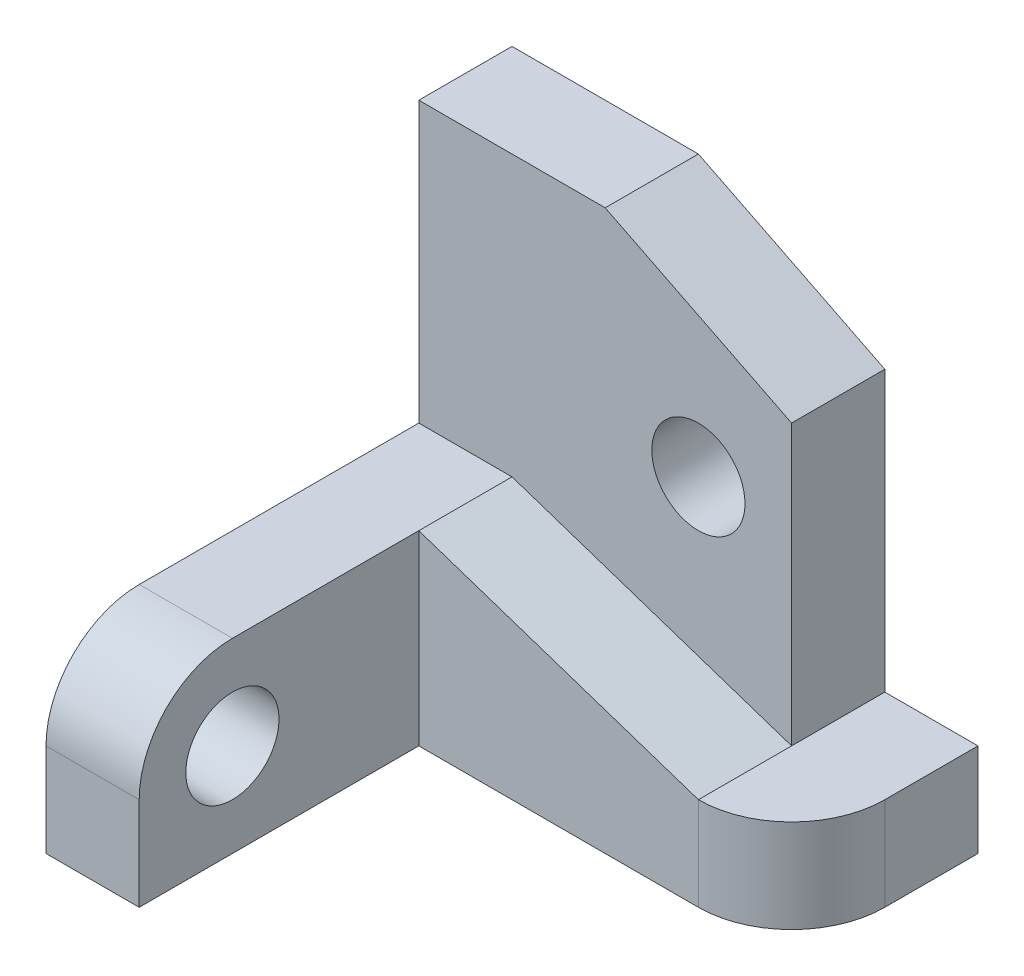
ISO-10303-21;
HEADER;
FILE_DESCRIPTION(('STEP AP214'),'2;1');
FILE_NAME('part.step','',(''),(''),'','','');
FILE_SCHEMA(('AUTOMOTIVE_DESIGN { 1 0 10303 214 1 1 1 1 }'));
ENDSEC;
DATA;
#1=APPLICATION_CONTEXT('core data for automotive mechanical design processes');
#2=APPLICATION_PROTOCOL_DEFINITION('international standard','automotive_design',2000,#1);
#3=PRODUCT_CONTEXT('',#1,'mechanical');
#4=PRODUCT('Part','Part','',(#3));
#5=PRODUCT_RELATED_PRODUCT_CATEGORY('part','',(#4));
#6=PRODUCT_DEFINITION_FORMATION('','',#4);
#7=PRODUCT_DEFINITION_CONTEXT('part definition',#1,'design');
#8=PRODUCT_DEFINITION('design','',#6,#7);
#9=PRODUCT_DEFINITION_SHAPE('','',#8);
#10=(LENGTH_UNIT() NAMED_UNIT(*) SI_UNIT(.MILLI.,.METRE.));
#11=(NAMED_UNIT(*) PLANE_ANGLE_UNIT() SI_UNIT($,.RADIAN.));
#12=(NAMED_UNIT(*) SI_UNIT($,.STERADIAN.) SOLID_ANGLE_UNIT());
#13=UNCERTAINTY_MEASURE_WITH_UNIT(LENGTH_MEASURE(1.E-05),#10,'distance_accuracy_value','');
#14=(GEOMETRIC_REPRESENTATION_CONTEXT(3) GLOBAL_UNCERTAINTY_ASSIGNED_CONTEXT((#13)) GLOBAL_UNIT_ASSIGNED_CONTEXT((#10,
#11,#12)) REPRESENTATION_CONTEXT('',''));
#15=CARTESIAN_POINT('',(0.,0.,0.));
#16=DIRECTION('',(0.,0.,1.));
#17=DIRECTION('',(1.,0.,0.));
#18=AXIS2_PLACEMENT_3D('',#15,#16,#17);
#19=CARTESIAN_POINT('',(40.,-43.0593932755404,10.));
#20=DIRECTION('',(1.,0.,0.));
#21=DIRECTION('',(0.,1.,0.));
#22=AXIS2_PLACEMENT_3D('',#19,#20,#21);
#23=PLANE('',#22);
#24=DIRECTION('',(0.,-1.,0.));
#25=VECTOR('',#24,1.);
#26=CARTESIAN_POINT('',(40.,-43.0593932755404,0.));
#27=LINE('',#26,#25);
#28=CARTESIAN_POINT('',(40.,40.,0.));
#29=VERTEX_POINT('',#28);
#30=CARTESIAN_POINT('',(40.,10.,0.));
#31=VERTEX_POINT('',#30);
#32=EDGE_CURVE('E205',#29,#31,#27,.T.);
#33=ORIENTED_EDGE('',*,*,#32,.F.);
#34=DIRECTION('',(0.,0.,-1.));
#35=VECTOR('',#34,1.);
#36=CARTESIAN_POINT('',(40.,40.,10.));
#37=LINE('',#36,#35);
#38=CARTESIAN_POINT('',(40.,40.,10.));
#39=VERTEX_POINT('',#38);
#40=EDGE_CURVE('E221',#39,#29,#37,.T.);
#41=ORIENTED_EDGE('',*,*,#40,.F.);
#42=DIRECTION('',(0.,-1.,0.));
#43=VECTOR('',#42,1.);
#44=CARTESIAN_POINT('',(40.,-43.0593932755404,10.));
#45=LINE('',#44,#43);
#46=CARTESIAN_POINT('',(40.,10.,10.));
#47=VERTEX_POINT('',#46);
#48=EDGE_CURVE('E184',#39,#47,#45,.T.);
#49=ORIENTED_EDGE('',*,*,#48,.T.);
#50=DIRECTION('',(0.,0.,-1.));
#51=VECTOR('',#50,1.);
#52=CARTESIAN_POINT('',(40.,10.,10.));
#53=LINE('',#52,#51);
#54=EDGE_CURVE('E202',#47,#31,#53,.T.);
#55=ORIENTED_EDGE('',*,*,#54,.T.);
#56=EDGE_LOOP('',(#33,#41,#49,#55));
#57=FACE_BOUND('',#56,.T.);
#58=ADVANCED_FACE('F32',(#57),#23,.T.);
#59=CARTESIAN_POINT('',(54.2837156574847,32.8581421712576,10.));
#60=DIRECTION('',(0.447213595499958,0.894427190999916,0.));
#61=DIRECTION('',(-0.894427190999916,0.447213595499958,0.));
#62=AXIS2_PLACEMENT_3D('',#59,#60,#61);
#63=PLANE('',#62);
#64=DIRECTION('',(0.894427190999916,-0.447213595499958,0.));
#65=VECTOR('',#64,1.);
#66=CARTESIAN_POINT('',(54.2837156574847,32.8581421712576,0.));
#67=LINE('',#66,#65);
#68=CARTESIAN_POINT('',(20.,50.,0.));
#69=VERTEX_POINT('',#68);
#70=EDGE_CURVE('E208',#69,#29,#67,.T.);
#71=ORIENTED_EDGE('',*,*,#70,.F.);
#72=DIRECTION('',(0.,0.,-1.));
#73=VECTOR('',#72,1.);
#74=CARTESIAN_POINT('',(20.,50.,10.));
#75=LINE('',#74,#73);
#76=CARTESIAN_POINT('',(20.,50.,10.));
#77=VERTEX_POINT('',#76);
#78=EDGE_CURVE('E219',#77,#69,#75,.T.);
#79=ORIENTED_EDGE('',*,*,#78,.F.);
#80=DIRECTION('',(0.894427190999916,-0.447213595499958,0.));
#81=VECTOR('',#80,1.);
#82=CARTESIAN_POINT('',(54.2837156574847,32.8581421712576,10.));
#83=LINE('',#82,#81);
#84=EDGE_CURVE('E187',#77,#39,#83,.T.);
#85=ORIENTED_EDGE('',*,*,#84,.T.);
#86=ORIENTED_EDGE('',*,*,#40,.T.);
#87=EDGE_LOOP('',(#71,#79,#85,#86));
#88=FACE_BOUND('',#87,.T.);
#89=ADVANCED_FACE('F263',(#88),#63,.T.);
#90=CARTESIAN_POINT('',(16.3249479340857,50.,10.));
#91=DIRECTION('',(0.,1.,0.));
#92=DIRECTION('',(0.,0.,1.));
#93=AXIS2_PLACEMENT_3D('',#90,#91,#92);
#94=PLANE('',#93);
#95=DIRECTION('',(1.,0.,0.));
#96=VECTOR('',#95,1.);
#97=CARTESIAN_POINT('',(16.3249479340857,50.,0.));
#98=LINE('',#97,#96);
#99=CARTESIAN_POINT('',(0.,50.,0.));
#100=VERTEX_POINT('',#99);
#101=EDGE_CURVE('E211',#100,#69,#98,.T.);
#102=ORIENTED_EDGE('',*,*,#101,.F.);
#103=DIRECTION('',(0.,0.,-1.));
#104=VECTOR('',#103,1.);
#105=CARTESIAN_POINT('',(0.,50.,10.));
#106=LINE('',#105,#104);
#107=CARTESIAN_POINT('',(0.,50.,10.));
#108=VERTEX_POINT('',#107);
#109=EDGE_CURVE('E217',#108,#100,#106,.T.);
#110=ORIENTED_EDGE('',*,*,#109,.F.);
#111=DIRECTION('',(1.,0.,0.));
#112=VECTOR('',#111,1.);
#113=CARTESIAN_POINT('',(16.3249479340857,50.,10.));
#114=LINE('',#113,#112);
#115=EDGE_CURVE('E190',#108,#77,#114,.T.);
#116=ORIENTED_EDGE('',*,*,#115,.T.);
#117=ORIENTED_EDGE('',*,*,#78,.T.);
#118=EDGE_LOOP('',(#102,#110,#116,#117));
#119=FACE_BOUND('',#118,.T.);
#120=ADVANCED_FACE('F269',(#119),#94,.T.);
#121=CARTESIAN_POINT('',(0.,-43.0593932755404,10.));
#122=DIRECTION('',(-1.,0.,0.));
#123=DIRECTION('',(0.,0.,1.));
#124=AXIS2_PLACEMENT_3D('',#121,#122,#123);
#125=PLANE('',#124);
#126=CARTESIAN_POINT('',(0.,10.,40.));
#127=DIRECTION('',(-1.,0.,0.));
#128=DIRECTION('',(0.,0.,1.));
#129=AXIS2_PLACEMENT_3D('',#126,#127,#128);
#130=CIRCLE('',#129,5.);
#131=CARTESIAN_POINT('',(0.,10.,45.));
#132=VERTEX_POINT('',#131);
#133=EDGE_CURVE('E312',#132,#132,#130,.T.);
#134=ORIENTED_EDGE('',*,*,#133,.F.);
#135=EDGE_LOOP('',(#134));
#136=FACE_BOUND('',#135,.T.);
#137=DIRECTION('',(0.,-1.,0.));
#138=VECTOR('',#137,1.);
#139=CARTESIAN_POINT('',(0.,-43.0593932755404,50.));
#140=LINE('',#139,#138);
#141=CARTESIAN_POINT('',(0.,9.99999999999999,50.));
#142=VERTEX_POINT('',#141);
#143=CARTESIAN_POINT('',(0.,0.,50.));
#144=VERTEX_POINT('',#143);
#145=EDGE_CURVE('E123',#142,#144,#140,.T.);
#146=ORIENTED_EDGE('',*,*,#145,.F.);
#147=CARTESIAN_POINT('',(0.,9.99999999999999,40.));
#148=DIRECTION('',(-1.,0.,0.));
#149=DIRECTION('',(0.,0.,1.));
#150=AXIS2_PLACEMENT_3D('',#147,#148,#149);
#151=CIRCLE('',#150,10.);
#152=CARTESIAN_POINT('',(0.,20.,40.));
#153=VERTEX_POINT('',#152);
#154=EDGE_CURVE('E224',#142,#153,#151,.T.);
#155=ORIENTED_EDGE('',*,*,#154,.T.);
#156=DIRECTION('',(0.,0.,-1.));
#157=VECTOR('',#156,1.);
#158=CARTESIAN_POINT('',(0.,20.,50.));
#159=LINE('',#158,#157);
#160=CARTESIAN_POINT('',(0.,20.,10.));
#161=VERTEX_POINT('',#160);
#162=EDGE_CURVE('E143',#153,#161,#159,.T.);
#163=ORIENTED_EDGE('',*,*,#162,.T.);
#164=DIRECTION('',(0.,1.,0.));
#165=VECTOR('',#164,1.);
#166=CARTESIAN_POINT('',(0.,-43.0593932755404,10.));
#167=LINE('',#166,#165);
#168=EDGE_CURVE('E193',#161,#108,#167,.T.);
#169=ORIENTED_EDGE('',*,*,#168,.T.);
#170=ORIENTED_EDGE('',*,*,#109,.T.);
#171=DIRECTION('',(0.,1.,0.));
#172=VECTOR('',#171,1.);
#173=CARTESIAN_POINT('',(0.,-43.0593932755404,0.));
#174=LINE('',#173,#172);
#175=CARTESIAN_POINT('',(0.,0.,0.));
#176=VERTEX_POINT('',#175);
#177=EDGE_CURVE('E139',#176,#100,#174,.T.);
#178=ORIENTED_EDGE('',*,*,#177,.F.);
#179=DIRECTION('',(0.,0.,-1.));
#180=VECTOR('',#179,1.);
#181=CARTESIAN_POINT('',(0.,0.,50.));
#182=LINE('',#181,#180);
#183=EDGE_CURVE('E136',#144,#176,#182,.T.);
#184=ORIENTED_EDGE('',*,*,#183,.F.);
#185=EDGE_LOOP('',(#146,#155,#163,#169,#170,#178,#184));
#186=FACE_BOUND('',#185,.T.);
#187=ADVANCED_FACE('F137',(#136,#186),#125,.T.);
#188=CARTESIAN_POINT('',(30.,30.,10.));
#189=DIRECTION('',(0.,0.,-1.));
#190=DIRECTION('',(-1.,0.,0.));
#191=AXIS2_PLACEMENT_3D('',#188,#189,#190);
#192=CYLINDRICAL_SURFACE('',#191,5.);
#193=CARTESIAN_POINT('',(30.,30.,10.));
#194=DIRECTION('',(0.,0.,1.));
#195=DIRECTION('',(1.,0.,0.));
#196=AXIS2_PLACEMENT_3D('',#193,#194,#195);
#197=CIRCLE('',#196,5.);
#198=CARTESIAN_POINT('',(35.,30.,10.));
#199=VERTEX_POINT('',#198);
#200=EDGE_CURVE('E181',#199,#199,#197,.T.);
#201=ORIENTED_EDGE('',*,*,#200,.T.);
#202=EDGE_LOOP('',(#201));
#203=FACE_BOUND('',#202,.T.);
#204=CARTESIAN_POINT('',(30.,30.,0.));
#205=DIRECTION('',(0.,0.,1.));
#206=DIRECTION('',(1.,0.,0.));
#207=AXIS2_PLACEMENT_3D('',#204,#205,#206);
#208=CIRCLE('',#207,5.);
#209=CARTESIAN_POINT('',(35.,30.,0.));
#210=VERTEX_POINT('',#209);
#211=EDGE_CURVE('E180',#210,#210,#208,.T.);
#212=ORIENTED_EDGE('',*,*,#211,.F.);
#213=EDGE_LOOP('',(#212));
#214=FACE_BOUND('',#213,.T.);
#215=ADVANCED_FACE('F275',(#203,#214),#192,.F.);
#216=CARTESIAN_POINT('',(16.3249479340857,-43.0593932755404,10.));
#217=DIRECTION('',(0.,0.,1.));
#218=DIRECTION('',(1.,0.,0.));
#219=AXIS2_PLACEMENT_3D('',#216,#217,#218);
#220=PLANE('',#219);
#221=ORIENTED_EDGE('',*,*,#200,.F.);
#222=EDGE_LOOP('',(#221));
#223=FACE_BOUND('',#222,.T.);
#224=ORIENTED_EDGE('',*,*,#48,.F.);
#225=ORIENTED_EDGE('',*,*,#84,.F.);
#226=ORIENTED_EDGE('',*,*,#115,.F.);
#227=ORIENTED_EDGE('',*,*,#168,.F.);
#228=DIRECTION('',(-1.,0.,0.));
#229=VECTOR('',#228,1.);
#230=CARTESIAN_POINT('',(16.3249479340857,20.,10.));
#231=LINE('',#230,#229);
#232=CARTESIAN_POINT('',(10.,20.,10.));
#233=VERTEX_POINT('',#232);
#234=EDGE_CURVE('E196',#233,#161,#231,.T.);
#235=ORIENTED_EDGE('',*,*,#234,.F.);
#236=DIRECTION('',(-0.948683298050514,0.316227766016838,0.));
#237=VECTOR('',#236,1.);
#238=CARTESIAN_POINT('',(34.6102711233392,11.7965762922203,10.));
#239=LINE('',#238,#237);
#240=EDGE_CURVE('E199',#47,#233,#239,.T.);
#241=ORIENTED_EDGE('',*,*,#240,.F.);
#242=EDGE_LOOP('',(#224,#225,#226,#227,#235,#241));
#243=FACE_BOUND('',#242,.T.);
#244=ADVANCED_FACE('F277',(#223,#243),#220,.T.);
#245=CARTESIAN_POINT('',(16.3249479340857,-43.0593932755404,0.));
#246=DIRECTION('',(0.,0.,1.));
#247=DIRECTION('',(1.,0.,0.));
#248=AXIS2_PLACEMENT_3D('',#245,#246,#247);
#249=PLANE('',#248);
#250=DIRECTION('',(1.,0.,0.));
#251=VECTOR('',#250,1.);
#252=CARTESIAN_POINT('',(16.3249479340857,0.,0.));
#253=LINE('',#252,#251);
#254=CARTESIAN_POINT('',(50.,0.,0.));
#255=VERTEX_POINT('',#254);
#256=EDGE_CURVE('E155',#176,#255,#253,.T.);
#257=ORIENTED_EDGE('',*,*,#256,.F.);
#258=ORIENTED_EDGE('',*,*,#177,.T.);
#259=ORIENTED_EDGE('',*,*,#101,.T.);
#260=ORIENTED_EDGE('',*,*,#70,.T.);
#261=ORIENTED_EDGE('',*,*,#32,.T.);
#262=DIRECTION('',(-1.,0.,0.));
#263=VECTOR('',#262,1.);
#264=CARTESIAN_POINT('',(16.3249479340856,9.99999999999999,0.));
#265=LINE('',#264,#263);
#266=CARTESIAN_POINT('',(50.,10.,0.));
#267=VERTEX_POINT('',#266);
#268=EDGE_CURVE('E160',#267,#31,#265,.T.);
#269=ORIENTED_EDGE('',*,*,#268,.F.);
#270=DIRECTION('',(0.,1.,0.));
#271=VECTOR('',#270,1.);
#272=CARTESIAN_POINT('',(50.,-43.0593932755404,0.));
#273=LINE('',#272,#271);
#274=EDGE_CURVE('E168',#255,#267,#273,.T.);
#275=ORIENTED_EDGE('',*,*,#274,.F.);
#276=EDGE_LOOP('',(#257,#258,#259,#260,#261,#269,#275));
#277=FACE_BOUND('',#276,.T.);
#278=ORIENTED_EDGE('',*,*,#211,.T.);
#279=EDGE_LOOP('',(#278));
#280=FACE_BOUND('',#279,.T.);
#281=ADVANCED_FACE('F283',(#277,#280),#249,.F.);
#282=CARTESIAN_POINT('',(34.6102711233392,11.7965762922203,20.));
#283=DIRECTION('',(-0.316227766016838,-0.948683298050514,0.));
#284=DIRECTION('',(0.948683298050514,-0.316227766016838,0.));
#285=AXIS2_PLACEMENT_3D('',#282,#283,#284);
#286=PLANE('',#285);
#287=ORIENTED_EDGE('',*,*,#240,.T.);
#288=DIRECTION('',(0.,0.,-1.));
#289=VECTOR('',#288,1.);
#290=CARTESIAN_POINT('',(10.,20.,20.));
#291=LINE('',#290,#289);
#292=CARTESIAN_POINT('',(10.,20.,20.));
#293=VERTEX_POINT('',#292);
#294=EDGE_CURVE('E178',#293,#233,#291,.T.);
#295=ORIENTED_EDGE('',*,*,#294,.F.);
#296=DIRECTION('',(-0.948683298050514,0.316227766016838,0.));
#297=VECTOR('',#296,1.);
#298=CARTESIAN_POINT('',(34.6102711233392,11.7965762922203,20.));
#299=LINE('',#298,#297);
#300=CARTESIAN_POINT('',(40.,10.,20.));
#301=VERTEX_POINT('',#300);
#302=EDGE_CURVE('E156',#301,#293,#299,.T.);
#303=ORIENTED_EDGE('',*,*,#302,.F.);
#304=DIRECTION('',(0.,0.,-1.));
#305=VECTOR('',#304,1.);
#306=CARTESIAN_POINT('',(40.,10.,20.));
#307=LINE('',#306,#305);
#308=EDGE_CURVE('E166',#301,#47,#307,.T.);
#309=ORIENTED_EDGE('',*,*,#308,.T.);
#310=EDGE_LOOP('',(#287,#295,#303,#309));
#311=FACE_BOUND('',#310,.T.);
#312=ADVANCED_FACE('F242',(#311),#286,.F.);
#313=CARTESIAN_POINT('',(16.3249479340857,0.,20.));
#314=DIRECTION('',(0.,1.,0.));
#315=DIRECTION('',(0.,0.,1.));
#316=AXIS2_PLACEMENT_3D('',#313,#314,#315);
#317=PLANE('',#316);
#318=DIRECTION('',(0.,0.,-1.));
#319=VECTOR('',#318,1.);
#320=CARTESIAN_POINT('',(50.,0.,20.));
#321=LINE('',#320,#319);
#322=CARTESIAN_POINT('',(50.,0.,10.));
#323=VERTEX_POINT('',#322);
#324=EDGE_CURVE('E176',#323,#255,#321,.T.);
#325=ORIENTED_EDGE('',*,*,#324,.F.);
#326=CARTESIAN_POINT('',(40.,0.,10.));
#327=DIRECTION('',(0.,1.,0.));
#328=DIRECTION('',(0.,0.,1.));
#329=AXIS2_PLACEMENT_3D('',#326,#327,#328);
#330=CIRCLE('',#329,10.);
#331=CARTESIAN_POINT('',(40.,0.,20.));
#332=VERTEX_POINT('',#331);
#333=EDGE_CURVE('E11',#323,#332,#330,.F.);
#334=ORIENTED_EDGE('',*,*,#333,.T.);
#335=DIRECTION('',(1.,0.,0.));
#336=VECTOR('',#335,1.);
#337=CARTESIAN_POINT('',(16.3249479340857,0.,20.));
#338=LINE('',#337,#336);
#339=CARTESIAN_POINT('',(10.,0.,20.));
#340=VERTEX_POINT('',#339);
#341=EDGE_CURVE('E163',#340,#332,#338,.T.);
#342=ORIENTED_EDGE('',*,*,#341,.F.);
#343=DIRECTION('',(0.,0.,-1.));
#344=VECTOR('',#343,1.);
#345=CARTESIAN_POINT('',(10.,0.,50.));
#346=LINE('',#345,#344);
#347=CARTESIAN_POINT('',(10.,0.,50.));
#348=VERTEX_POINT('',#347);
#349=EDGE_CURVE('E144',#348,#340,#346,.T.);
#350=ORIENTED_EDGE('',*,*,#349,.F.);
#351=DIRECTION('',(1.,0.,0.));
#352=VECTOR('',#351,1.);
#353=CARTESIAN_POINT('',(16.3249479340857,0.,50.));
#354=LINE('',#353,#352);
#355=EDGE_CURVE('E128',#144,#348,#354,.T.);
#356=ORIENTED_EDGE('',*,*,#355,.F.);
#357=ORIENTED_EDGE('',*,*,#183,.T.);
#358=ORIENTED_EDGE('',*,*,#256,.T.);
#359=EDGE_LOOP('',(#325,#334,#342,#350,#356,#357,#358));
#360=FACE_BOUND('',#359,.T.);
#361=ADVANCED_FACE('F146',(#360),#317,.F.);
#362=CARTESIAN_POINT('',(50.,-43.0593932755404,20.));
#363=DIRECTION('',(-1.,0.,0.));
#364=DIRECTION('',(0.,0.,1.));
#365=AXIS2_PLACEMENT_3D('',#362,#363,#364);
#366=PLANE('',#365);
#367=DIRECTION('',(0.,0.,-1.));
#368=VECTOR('',#367,1.);
#369=CARTESIAN_POINT('',(50.,10.,20.));
#370=LINE('',#369,#368);
#371=CARTESIAN_POINT('',(50.,10.,10.));
#372=VERTEX_POINT('',#371);
#373=EDGE_CURVE('E174',#372,#267,#370,.T.);
#374=ORIENTED_EDGE('',*,*,#373,.F.);
#375=DIRECTION('',(0.,1.,0.));
#376=VECTOR('',#375,1.);
#377=CARTESIAN_POINT('',(50.,0.,10.));
#378=LINE('',#377,#376);
#379=EDGE_CURVE('E40',#372,#323,#378,.F.);
#380=ORIENTED_EDGE('',*,*,#379,.T.);
#381=ORIENTED_EDGE('',*,*,#324,.T.);
#382=ORIENTED_EDGE('',*,*,#274,.T.);
#383=EDGE_LOOP('',(#374,#380,#381,#382));
#384=FACE_BOUND('',#383,.T.);
#385=ADVANCED_FACE('F308',(#384),#366,.F.);
#386=CARTESIAN_POINT('',(16.3249479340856,9.99999999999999,20.));
#387=DIRECTION('',(0.,-1.,0.));
#388=DIRECTION('',(1.,0.,0.));
#389=AXIS2_PLACEMENT_3D('',#386,#387,#388);
#390=PLANE('',#389);
#391=ORIENTED_EDGE('',*,*,#308,.F.);
#392=CARTESIAN_POINT('',(40.,10.,10.));
#393=DIRECTION('',(0.,-1.,0.));
#394=DIRECTION('',(1.,0.,0.));
#395=AXIS2_PLACEMENT_3D('',#392,#393,#394);
#396=CIRCLE('',#395,10.);
#397=EDGE_CURVE('E54',#301,#372,#396,.F.);
#398=ORIENTED_EDGE('',*,*,#397,.T.);
#399=ORIENTED_EDGE('',*,*,#373,.T.);
#400=ORIENTED_EDGE('',*,*,#268,.T.);
#401=ORIENTED_EDGE('',*,*,#54,.F.);
#402=EDGE_LOOP('',(#391,#398,#399,#400,#401));
#403=FACE_BOUND('',#402,.T.);
#404=ADVANCED_FACE('F240',(#403),#390,.F.);
#405=CARTESIAN_POINT('',(16.3249479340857,-43.0593932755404,20.));
#406=DIRECTION('',(0.,0.,1.));
#407=DIRECTION('',(1.,0.,0.));
#408=AXIS2_PLACEMENT_3D('',#405,#406,#407);
#409=PLANE('',#408);
#410=ORIENTED_EDGE('',*,*,#341,.T.);
#411=DIRECTION('',(0.,1.,0.));
#412=VECTOR('',#411,1.);
#413=CARTESIAN_POINT('',(40.,10.,20.));
#414=LINE('',#413,#412);
#415=EDGE_CURVE('E230',#332,#301,#414,.T.);
#416=ORIENTED_EDGE('',*,*,#415,.T.);
#417=ORIENTED_EDGE('',*,*,#302,.T.);
#418=DIRECTION('',(0.,-1.,0.));
#419=VECTOR('',#418,1.);
#420=CARTESIAN_POINT('',(10.,-43.0593932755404,20.));
#421=LINE('',#420,#419);
#422=EDGE_CURVE('E159',#293,#340,#421,.T.);
#423=ORIENTED_EDGE('',*,*,#422,.T.);
#424=EDGE_LOOP('',(#410,#416,#417,#423));
#425=FACE_BOUND('',#424,.T.);
#426=ADVANCED_FACE('F235',(#425),#409,.T.);
#427=CARTESIAN_POINT('',(10.,-43.0593932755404,50.));
#428=DIRECTION('',(1.,0.,0.));
#429=DIRECTION('',(0.,0.,-1.));
#430=AXIS2_PLACEMENT_3D('',#427,#428,#429);
#431=PLANE('',#430);
#432=CARTESIAN_POINT('',(10.,10.,40.));
#433=DIRECTION('',(1.,0.,0.));
#434=DIRECTION('',(0.,0.,-1.));
#435=AXIS2_PLACEMENT_3D('',#432,#433,#434);
#436=CIRCLE('',#435,5.);
#437=CARTESIAN_POINT('',(10.,10.,35.));
#438=VERTEX_POINT('',#437);
#439=EDGE_CURVE('E314',#438,#438,#436,.T.);
#440=ORIENTED_EDGE('',*,*,#439,.F.);
#441=EDGE_LOOP('',(#440));
#442=FACE_BOUND('',#441,.T.);
#443=DIRECTION('',(0.,0.,-1.));
#444=VECTOR('',#443,1.);
#445=CARTESIAN_POINT('',(10.,20.,50.));
#446=LINE('',#445,#444);
#447=CARTESIAN_POINT('',(10.,20.,40.));
#448=VERTEX_POINT('',#447);
#449=EDGE_CURVE('E153',#448,#293,#446,.T.);
#450=ORIENTED_EDGE('',*,*,#449,.F.);
#451=CARTESIAN_POINT('',(10.,9.99999999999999,40.));
#452=DIRECTION('',(1.,0.,0.));
#453=DIRECTION('',(0.,0.,-1.));
#454=AXIS2_PLACEMENT_3D('',#451,#452,#453);
#455=CIRCLE('',#454,10.);
#456=CARTESIAN_POINT('',(10.,9.99999999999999,50.));
#457=VERTEX_POINT('',#456);
#458=EDGE_CURVE('E228',#448,#457,#455,.T.);
#459=ORIENTED_EDGE('',*,*,#458,.T.);
#460=DIRECTION('',(0.,-1.,0.));
#461=VECTOR('',#460,1.);
#462=CARTESIAN_POINT('',(10.,-43.0593932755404,50.));
#463=LINE('',#462,#461);
#464=EDGE_CURVE('E133',#457,#348,#463,.T.);
#465=ORIENTED_EDGE('',*,*,#464,.T.);
#466=ORIENTED_EDGE('',*,*,#349,.T.);
#467=ORIENTED_EDGE('',*,*,#422,.F.);
#468=EDGE_LOOP('',(#450,#459,#465,#466,#467));
#469=FACE_BOUND('',#468,.T.);
#470=ADVANCED_FACE('F254',(#442,#469),#431,.T.);
#471=CARTESIAN_POINT('',(16.3249479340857,20.,50.));
#472=DIRECTION('',(0.,-1.,0.));
#473=DIRECTION('',(0.,0.,-1.));
#474=AXIS2_PLACEMENT_3D('',#471,#472,#473);
#475=PLANE('',#474);
#476=ORIENTED_EDGE('',*,*,#162,.F.);
#477=DIRECTION('',(-1.,0.,0.));
#478=VECTOR('',#477,1.);
#479=CARTESIAN_POINT('',(10.,20.,40.));
#480=LINE('',#479,#478);
#481=EDGE_CURVE('E226',#153,#448,#480,.F.);
#482=ORIENTED_EDGE('',*,*,#481,.T.);
#483=ORIENTED_EDGE('',*,*,#449,.T.);
#484=ORIENTED_EDGE('',*,*,#294,.T.);
#485=ORIENTED_EDGE('',*,*,#234,.T.);
#486=EDGE_LOOP('',(#476,#482,#483,#484,#485));
#487=FACE_BOUND('',#486,.T.);
#488=ADVANCED_FACE('F247',(#487),#475,.F.);
#489=CARTESIAN_POINT('',(16.3249479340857,-43.0593932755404,50.));
#490=DIRECTION('',(0.,0.,1.));
#491=DIRECTION('',(1.,0.,0.));
#492=AXIS2_PLACEMENT_3D('',#489,#490,#491);
#493=PLANE('',#492);
#494=ORIENTED_EDGE('',*,*,#464,.F.);
#495=DIRECTION('',(-1.,0.,0.));
#496=VECTOR('',#495,1.);
#497=CARTESIAN_POINT('',(0.,9.99999999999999,50.));
#498=LINE('',#497,#496);
#499=EDGE_CURVE('E131',#457,#142,#498,.T.);
#500=ORIENTED_EDGE('',*,*,#499,.T.);
#501=ORIENTED_EDGE('',*,*,#145,.T.);
#502=ORIENTED_EDGE('',*,*,#355,.T.);
#503=EDGE_LOOP('',(#494,#500,#501,#502));
#504=FACE_BOUND('',#503,.T.);
#505=ADVANCED_FACE('F126',(#504),#493,.T.);
#506=CARTESIAN_POINT('',(-40.,10.,40.));
#507=DIRECTION('',(1.,0.,0.));
#508=DIRECTION('',(0.,0.,-1.));
#509=AXIS2_PLACEMENT_3D('',#506,#507,#508);
#510=CYLINDRICAL_SURFACE('',#509,5.);
#511=ORIENTED_EDGE('',*,*,#133,.T.);
#512=EDGE_LOOP('',(#511));
#513=FACE_BOUND('',#512,.T.);
#514=ORIENTED_EDGE('',*,*,#439,.T.);
#515=EDGE_LOOP('',(#514));
#516=FACE_BOUND('',#515,.T.);
#517=ADVANCED_FACE('F260',(#513,#516),#510,.F.);
#518=CARTESIAN_POINT('',(16.3249479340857,9.99999999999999,40.));
#519=DIRECTION('',(1.,0.,0.));
#520=DIRECTION('',(0.,0.,-1.));
#521=AXIS2_PLACEMENT_3D('',#518,#519,#520);
#522=CYLINDRICAL_SURFACE('',#521,10.);
#523=ORIENTED_EDGE('',*,*,#458,.F.);
#524=ORIENTED_EDGE('',*,*,#481,.F.);
#525=ORIENTED_EDGE('',*,*,#154,.F.);
#526=ORIENTED_EDGE('',*,*,#499,.F.);
#527=EDGE_LOOP('',(#523,#524,#525,#526));
#528=FACE_BOUND('',#527,.T.);
#529=ADVANCED_FACE('F256',(#528),#522,.T.);
#530=CARTESIAN_POINT('',(40.,-43.0593932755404,10.));
#531=DIRECTION('',(0.,-1.,0.));
#532=DIRECTION('',(0.,0.,-1.));
#533=AXIS2_PLACEMENT_3D('',#530,#531,#532);
#534=CYLINDRICAL_SURFACE('',#533,10.);
#535=ORIENTED_EDGE('',*,*,#333,.F.);
#536=ORIENTED_EDGE('',*,*,#379,.F.);
#537=ORIENTED_EDGE('',*,*,#397,.F.);
#538=ORIENTED_EDGE('',*,*,#415,.F.);
#539=EDGE_LOOP('',(#535,#536,#537,#538));
#540=FACE_BOUND('',#539,.T.);
#541=ADVANCED_FACE('F34',(#540),#534,.T.);
#542=CLOSED_SHELL('',(#58,#89,#120,#187,#215,#244,#281,#312,#361,#385,#404,#426,#470,#488,#505,
#517,#529,#541));
#543=MANIFOLD_SOLID_BREP('B2',#542);
#544=ADVANCED_BREP_SHAPE_REPRESENTATION('',(#18,#543),#14);
#545=SHAPE_DEFINITION_REPRESENTATION(#9,#544);
ENDSEC;
END-ISO-10303-21;
